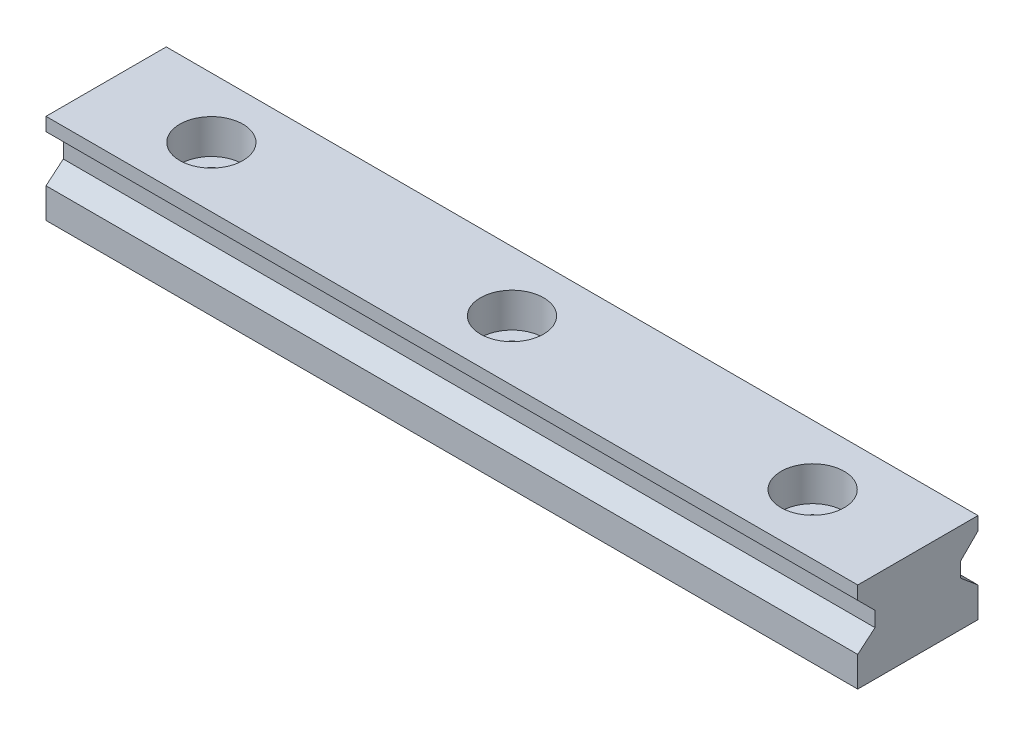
ISO-10303-21;
HEADER;
FILE_DESCRIPTION(('STEP AP214'),'2;1');
FILE_NAME('part.step','',(''),(''),'','','');
FILE_SCHEMA(('AUTOMOTIVE_DESIGN { 1 0 10303 214 1 1 1 1 }'));
ENDSEC;
DATA;
#1=APPLICATION_CONTEXT('core data for automotive mechanical design processes');
#2=APPLICATION_PROTOCOL_DEFINITION('international standard','automotive_design',2000,#1);
#3=PRODUCT_CONTEXT('',#1,'mechanical');
#4=PRODUCT('Part','Part','',(#3));
#5=PRODUCT_RELATED_PRODUCT_CATEGORY('part','',(#4));
#6=PRODUCT_DEFINITION_FORMATION('','',#4);
#7=PRODUCT_DEFINITION_CONTEXT('part definition',#1,'design');
#8=PRODUCT_DEFINITION('design','',#6,#7);
#9=PRODUCT_DEFINITION_SHAPE('','',#8);
#10=(LENGTH_UNIT() NAMED_UNIT(*) SI_UNIT(.MILLI.,.METRE.));
#11=(NAMED_UNIT(*) PLANE_ANGLE_UNIT() SI_UNIT($,.RADIAN.));
#12=(NAMED_UNIT(*) SI_UNIT($,.STERADIAN.) SOLID_ANGLE_UNIT());
#13=UNCERTAINTY_MEASURE_WITH_UNIT(LENGTH_MEASURE(1.E-05),#10,'distance_accuracy_value','');
#14=(GEOMETRIC_REPRESENTATION_CONTEXT(3) GLOBAL_UNCERTAINTY_ASSIGNED_CONTEXT((#13)) GLOBAL_UNIT_ASSIGNED_CONTEXT((#10,
#11,#12)) REPRESENTATION_CONTEXT('',''));
#15=CARTESIAN_POINT('',(0.,0.,0.));
#16=DIRECTION('',(0.,0.,1.));
#17=DIRECTION('',(1.,0.,0.));
#18=AXIS2_PLACEMENT_3D('',#15,#16,#17);
#19=CARTESIAN_POINT('',(-27.,5.114964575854,4.));
#20=DIRECTION('',(0.,-0.707106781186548,0.707106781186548));
#21=DIRECTION('',(0.,-0.707106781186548,-0.707106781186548));
#22=AXIS2_PLACEMENT_3D('',#19,#20,#21);
#23=PLANE('',#22);
#24=DIRECTION('',(1.,0.,0.));
#25=VECTOR('',#24,1.);
#26=CARTESIAN_POINT('',(-27.,5.114964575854,4.));
#27=LINE('',#26,#25);
#28=CARTESIAN_POINT('',(-27.,5.114964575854,4.));
#29=VERTEX_POINT('',#28);
#30=CARTESIAN_POINT('',(27.,5.114964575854,4.));
#31=VERTEX_POINT('',#30);
#32=EDGE_CURVE('E209',#29,#31,#27,.T.);
#33=ORIENTED_EDGE('',*,*,#32,.F.);
#34=DIRECTION('',(0.,-0.707106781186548,-0.707106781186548));
#35=VECTOR('',#34,1.);
#36=CARTESIAN_POINT('',(-27.,5.114964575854,4.));
#37=LINE('',#36,#35);
#38=CARTESIAN_POINT('',(-27.,3.964964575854,2.85));
#39=VERTEX_POINT('',#38);
#40=EDGE_CURVE('E117',#29,#39,#37,.T.);
#41=ORIENTED_EDGE('',*,*,#40,.T.);
#42=DIRECTION('',(1.,0.,0.));
#43=VECTOR('',#42,1.);
#44=CARTESIAN_POINT('',(-27.,3.964964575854,2.85));
#45=LINE('',#44,#43);
#46=CARTESIAN_POINT('',(27.,3.964964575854,2.85));
#47=VERTEX_POINT('',#46);
#48=EDGE_CURVE('E214',#47,#39,#45,.F.);
#49=ORIENTED_EDGE('',*,*,#48,.F.);
#50=DIRECTION('',(0.,-0.707106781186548,-0.707106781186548));
#51=VECTOR('',#50,1.);
#52=CARTESIAN_POINT('',(27.,5.114964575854,4.));
#53=LINE('',#52,#51);
#54=EDGE_CURVE('E136',#47,#31,#53,.F.);
#55=ORIENTED_EDGE('',*,*,#54,.T.);
#56=EDGE_LOOP('',(#33,#41,#49,#55));
#57=FACE_BOUND('',#56,.T.);
#58=ADVANCED_FACE('F16',(#57),#23,.T.);
#59=CARTESIAN_POINT('',(-27.,3.964964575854,-2.85));
#60=DIRECTION('',(0.,-0.707106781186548,-0.707106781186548));
#61=DIRECTION('',(0.,0.707106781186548,-0.707106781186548));
#62=AXIS2_PLACEMENT_3D('',#59,#60,#61);
#63=PLANE('',#62);
#64=DIRECTION('',(-1.,0.,0.));
#65=VECTOR('',#64,1.);
#66=CARTESIAN_POINT('',(-27.,3.964964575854,-2.85));
#67=LINE('',#66,#65);
#68=CARTESIAN_POINT('',(-27.,3.964964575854,-2.85));
#69=VERTEX_POINT('',#68);
#70=CARTESIAN_POINT('',(27.,3.964964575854,-2.85));
#71=VERTEX_POINT('',#70);
#72=EDGE_CURVE('E111',#69,#71,#67,.F.);
#73=ORIENTED_EDGE('',*,*,#72,.F.);
#74=DIRECTION('',(0.,0.707106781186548,-0.707106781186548));
#75=VECTOR('',#74,1.);
#76=CARTESIAN_POINT('',(-27.,3.964964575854,-2.85));
#77=LINE('',#76,#75);
#78=CARTESIAN_POINT('',(-27.,5.114964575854,-4.));
#79=VERTEX_POINT('',#78);
#80=EDGE_CURVE('E102',#69,#79,#77,.T.);
#81=ORIENTED_EDGE('',*,*,#80,.T.);
#82=DIRECTION('',(-1.,0.,0.));
#83=VECTOR('',#82,1.);
#84=CARTESIAN_POINT('',(-27.,5.114964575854,-4.));
#85=LINE('',#84,#83);
#86=CARTESIAN_POINT('',(27.,5.114964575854,-4.));
#87=VERTEX_POINT('',#86);
#88=EDGE_CURVE('E114',#87,#79,#85,.T.);
#89=ORIENTED_EDGE('',*,*,#88,.F.);
#90=DIRECTION('',(0.,0.707106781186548,-0.707106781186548));
#91=VECTOR('',#90,1.);
#92=CARTESIAN_POINT('',(27.,3.964964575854,-2.85));
#93=LINE('',#92,#91);
#94=EDGE_CURVE('E107',#87,#71,#93,.F.);
#95=ORIENTED_EDGE('',*,*,#94,.T.);
#96=EDGE_LOOP('',(#73,#81,#89,#95));
#97=FACE_BOUND('',#96,.T.);
#98=ADVANCED_FACE('F109',(#97),#63,.T.);
#99=CARTESIAN_POINT('',(-27.,2.964964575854,-2.85));
#100=DIRECTION('',(0.,0.,-1.));
#101=DIRECTION('',(-1.,0.,0.));
#102=AXIS2_PLACEMENT_3D('',#99,#100,#101);
#103=PLANE('',#102);
#104=DIRECTION('',(1.,0.,0.));
#105=VECTOR('',#104,1.);
#106=CARTESIAN_POINT('',(-27.,2.96496457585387,-2.84999999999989));
#107=LINE('',#106,#105);
#108=CARTESIAN_POINT('',(-27.,2.96496457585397,-2.84999999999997));
#109=VERTEX_POINT('',#108);
#110=CARTESIAN_POINT('',(27.,2.96496457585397,-2.84999999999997));
#111=VERTEX_POINT('',#110);
#112=EDGE_CURVE('E197',#109,#111,#107,.T.);
#113=ORIENTED_EDGE('',*,*,#112,.F.);
#114=DIRECTION('',(0.,1.,0.));
#115=VECTOR('',#114,1.);
#116=CARTESIAN_POINT('',(-27.,2.964964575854,-2.85));
#117=LINE('',#116,#115);
#118=EDGE_CURVE('E128',#109,#69,#117,.T.);
#119=ORIENTED_EDGE('',*,*,#118,.T.);
#120=ORIENTED_EDGE('',*,*,#72,.T.);
#121=DIRECTION('',(0.,1.,0.));
#122=VECTOR('',#121,1.);
#123=CARTESIAN_POINT('',(27.,2.964964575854,-2.85));
#124=LINE('',#123,#122);
#125=EDGE_CURVE('E120',#71,#111,#124,.F.);
#126=ORIENTED_EDGE('',*,*,#125,.T.);
#127=EDGE_LOOP('',(#113,#119,#120,#126));
#128=FACE_BOUND('',#127,.T.);
#129=ADVANCED_FACE('F130',(#128),#103,.T.);
#130=CARTESIAN_POINT('',(-27.,3.964964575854,2.85));
#131=DIRECTION('',(0.,0.,1.));
#132=DIRECTION('',(1.,0.,0.));
#133=AXIS2_PLACEMENT_3D('',#130,#131,#132);
#134=PLANE('',#133);
#135=ORIENTED_EDGE('',*,*,#48,.T.);
#136=DIRECTION('',(0.,1.,0.));
#137=VECTOR('',#136,1.);
#138=CARTESIAN_POINT('',(-27.,3.964964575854,2.85));
#139=LINE('',#138,#137);
#140=CARTESIAN_POINT('',(-27.,2.964964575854,2.85));
#141=VERTEX_POINT('',#140);
#142=EDGE_CURVE('E212',#39,#141,#139,.F.);
#143=ORIENTED_EDGE('',*,*,#142,.T.);
#144=DIRECTION('',(1.,0.,0.));
#145=VECTOR('',#144,1.);
#146=CARTESIAN_POINT('',(-27.,2.964964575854,2.85));
#147=LINE('',#146,#145);
#148=CARTESIAN_POINT('',(27.,2.964964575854,2.85));
#149=VERTEX_POINT('',#148);
#150=EDGE_CURVE('E190',#149,#141,#147,.F.);
#151=ORIENTED_EDGE('',*,*,#150,.F.);
#152=DIRECTION('',(0.,1.,0.));
#153=VECTOR('',#152,1.);
#154=CARTESIAN_POINT('',(27.,3.964964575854,2.85));
#155=LINE('',#154,#153);
#156=EDGE_CURVE('E217',#149,#47,#155,.T.);
#157=ORIENTED_EDGE('',*,*,#156,.T.);
#158=EDGE_LOOP('',(#135,#143,#151,#157));
#159=FACE_BOUND('',#158,.T.);
#160=ADVANCED_FACE('F221',(#159),#134,.T.);
#161=CARTESIAN_POINT('',(-27.,6.,4.));
#162=DIRECTION('',(0.,0.,1.));
#163=DIRECTION('',(1.,0.,0.));
#164=AXIS2_PLACEMENT_3D('',#161,#162,#163);
#165=PLANE('',#164);
#166=DIRECTION('',(1.,0.,0.));
#167=VECTOR('',#166,1.);
#168=CARTESIAN_POINT('',(-27.,6.,4.));
#169=LINE('',#168,#167);
#170=CARTESIAN_POINT('',(-27.,6.,4.));
#171=VERTEX_POINT('',#170);
#172=CARTESIAN_POINT('',(27.,6.,4.));
#173=VERTEX_POINT('',#172);
#174=EDGE_CURVE('E176',#171,#173,#169,.T.);
#175=ORIENTED_EDGE('',*,*,#174,.F.);
#176=DIRECTION('',(0.,1.,0.));
#177=VECTOR('',#176,1.);
#178=CARTESIAN_POINT('',(-27.,6.,4.));
#179=LINE('',#178,#177);
#180=EDGE_CURVE('E204',#171,#29,#179,.F.);
#181=ORIENTED_EDGE('',*,*,#180,.T.);
#182=ORIENTED_EDGE('',*,*,#32,.T.);
#183=DIRECTION('',(0.,1.,0.));
#184=VECTOR('',#183,1.);
#185=CARTESIAN_POINT('',(27.,6.,4.));
#186=LINE('',#185,#184);
#187=EDGE_CURVE('E207',#31,#173,#186,.T.);
#188=ORIENTED_EDGE('',*,*,#187,.T.);
#189=EDGE_LOOP('',(#175,#181,#182,#188));
#190=FACE_BOUND('',#189,.T.);
#191=ADVANCED_FACE('F322',(#190),#165,.T.);
#192=CARTESIAN_POINT('',(-27.,5.114964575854,-4.));
#193=DIRECTION('',(0.,0.,-1.));
#194=DIRECTION('',(-1.,0.,0.));
#195=AXIS2_PLACEMENT_3D('',#192,#193,#194);
#196=PLANE('',#195);
#197=ORIENTED_EDGE('',*,*,#88,.T.);
#198=DIRECTION('',(0.,1.,0.));
#199=VECTOR('',#198,1.);
#200=CARTESIAN_POINT('',(-27.,5.114964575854,-4.));
#201=LINE('',#200,#199);
#202=CARTESIAN_POINT('',(-27.,6.,-4.));
#203=VERTEX_POINT('',#202);
#204=EDGE_CURVE('E199',#79,#203,#201,.T.);
#205=ORIENTED_EDGE('',*,*,#204,.T.);
#206=DIRECTION('',(1.,0.,0.));
#207=VECTOR('',#206,1.);
#208=CARTESIAN_POINT('',(-27.,6.,-4.));
#209=LINE('',#208,#207);
#210=CARTESIAN_POINT('',(27.,6.,-4.));
#211=VERTEX_POINT('',#210);
#212=EDGE_CURVE('E172',#211,#203,#209,.F.);
#213=ORIENTED_EDGE('',*,*,#212,.F.);
#214=DIRECTION('',(0.,1.,0.));
#215=VECTOR('',#214,1.);
#216=CARTESIAN_POINT('',(27.,5.114964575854,-4.));
#217=LINE('',#216,#215);
#218=EDGE_CURVE('E202',#211,#87,#217,.F.);
#219=ORIENTED_EDGE('',*,*,#218,.T.);
#220=EDGE_LOOP('',(#197,#205,#213,#219));
#221=FACE_BOUND('',#220,.T.);
#222=ADVANCED_FACE('F313',(#221),#196,.T.);
#223=CARTESIAN_POINT('',(20.,-0.3,0.));
#224=DIRECTION('',(0.,1.,0.));
#225=DIRECTION('',(0.,0.,1.));
#226=AXIS2_PLACEMENT_3D('',#223,#224,#225);
#227=CYLINDRICAL_SURFACE('',#226,2.1);
#228=CARTESIAN_POINT('',(20.,3.7,0.));
#229=DIRECTION('',(0.,1.,0.));
#230=DIRECTION('',(0.,0.,1.));
#231=AXIS2_PLACEMENT_3D('',#228,#229,#230);
#232=CIRCLE('',#231,2.1);
#233=CARTESIAN_POINT('',(20.,3.7,2.1));
#234=VERTEX_POINT('',#233);
#235=EDGE_CURVE('E162',#234,#234,#232,.T.);
#236=ORIENTED_EDGE('',*,*,#235,.F.);
#237=EDGE_LOOP('',(#236));
#238=FACE_BOUND('',#237,.T.);
#239=CARTESIAN_POINT('',(20.,6.,0.));
#240=DIRECTION('',(0.,1.,0.));
#241=DIRECTION('',(0.,0.,1.));
#242=AXIS2_PLACEMENT_3D('',#239,#240,#241);
#243=CIRCLE('',#242,2.1);
#244=CARTESIAN_POINT('',(20.,6.,2.1));
#245=VERTEX_POINT('',#244);
#246=EDGE_CURVE('E19',#245,#245,#243,.F.);
#247=ORIENTED_EDGE('',*,*,#246,.F.);
#248=EDGE_LOOP('',(#247));
#249=FACE_BOUND('',#248,.T.);
#250=ADVANCED_FACE('F309',(#238,#249),#227,.F.);
#251=CARTESIAN_POINT('',(0.,-0.3,0.));
#252=DIRECTION('',(0.,1.,0.));
#253=DIRECTION('',(0.,0.,1.));
#254=AXIS2_PLACEMENT_3D('',#251,#252,#253);
#255=CYLINDRICAL_SURFACE('',#254,2.1);
#256=CARTESIAN_POINT('',(0.,3.7,0.));
#257=DIRECTION('',(0.,1.,0.));
#258=DIRECTION('',(0.,0.,1.));
#259=AXIS2_PLACEMENT_3D('',#256,#257,#258);
#260=CIRCLE('',#259,2.1);
#261=CARTESIAN_POINT('',(0.,3.7,2.1));
#262=VERTEX_POINT('',#261);
#263=EDGE_CURVE('E159',#262,#262,#260,.T.);
#264=ORIENTED_EDGE('',*,*,#263,.F.);
#265=EDGE_LOOP('',(#264));
#266=FACE_BOUND('',#265,.T.);
#267=CARTESIAN_POINT('',(0.,6.,0.));
#268=DIRECTION('',(0.,1.,0.));
#269=DIRECTION('',(0.,0.,1.));
#270=AXIS2_PLACEMENT_3D('',#267,#268,#269);
#271=CIRCLE('',#270,2.1);
#272=CARTESIAN_POINT('',(0.,6.,2.1));
#273=VERTEX_POINT('',#272);
#274=EDGE_CURVE('E167',#273,#273,#271,.F.);
#275=ORIENTED_EDGE('',*,*,#274,.F.);
#276=EDGE_LOOP('',(#275));
#277=FACE_BOUND('',#276,.T.);
#278=ADVANCED_FACE('F312',(#266,#277),#255,.F.);
#279=CARTESIAN_POINT('',(-20.,-0.3,0.));
#280=DIRECTION('',(0.,1.,0.));
#281=DIRECTION('',(0.,0.,1.));
#282=AXIS2_PLACEMENT_3D('',#279,#280,#281);
#283=CYLINDRICAL_SURFACE('',#282,2.1);
#284=CARTESIAN_POINT('',(-20.,3.7,0.));
#285=DIRECTION('',(0.,1.,0.));
#286=DIRECTION('',(0.,0.,1.));
#287=AXIS2_PLACEMENT_3D('',#284,#285,#286);
#288=CIRCLE('',#287,2.1);
#289=CARTESIAN_POINT('',(-20.,3.7,2.1));
#290=VERTEX_POINT('',#289);
#291=EDGE_CURVE('E155',#290,#290,#288,.T.);
#292=ORIENTED_EDGE('',*,*,#291,.F.);
#293=EDGE_LOOP('',(#292));
#294=FACE_BOUND('',#293,.T.);
#295=CARTESIAN_POINT('',(-20.,6.,0.));
#296=DIRECTION('',(0.,1.,0.));
#297=DIRECTION('',(0.,0.,1.));
#298=AXIS2_PLACEMENT_3D('',#295,#296,#297);
#299=CIRCLE('',#298,2.1);
#300=CARTESIAN_POINT('',(-20.,6.,2.1));
#301=VERTEX_POINT('',#300);
#302=EDGE_CURVE('E165',#301,#301,#299,.F.);
#303=ORIENTED_EDGE('',*,*,#302,.F.);
#304=EDGE_LOOP('',(#303));
#305=FACE_BOUND('',#304,.T.);
#306=ADVANCED_FACE('F319',(#294,#305),#283,.F.);
#307=CARTESIAN_POINT('',(-27.,2.,-4.));
#308=DIRECTION('',(0.,0.766044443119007,-0.642787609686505));
#309=DIRECTION('',(0.,0.642787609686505,0.766044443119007));
#310=AXIS2_PLACEMENT_3D('',#307,#308,#309);
#311=PLANE('',#310);
#312=DIRECTION('',(-1.,0.,0.));
#313=VECTOR('',#312,1.);
#314=CARTESIAN_POINT('',(-27.,2.,-4.));
#315=LINE('',#314,#313);
#316=CARTESIAN_POINT('',(-27.,2.,-4.));
#317=VERTEX_POINT('',#316);
#318=CARTESIAN_POINT('',(27.,2.,-4.));
#319=VERTEX_POINT('',#318);
#320=EDGE_CURVE('E158',#317,#319,#315,.F.);
#321=ORIENTED_EDGE('',*,*,#320,.F.);
#322=DIRECTION('',(0.,0.642787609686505,0.766044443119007));
#323=VECTOR('',#322,1.);
#324=CARTESIAN_POINT('',(-27.,2.,-4.));
#325=LINE('',#324,#323);
#326=EDGE_CURVE('E193',#317,#109,#325,.T.);
#327=ORIENTED_EDGE('',*,*,#326,.T.);
#328=ORIENTED_EDGE('',*,*,#112,.T.);
#329=DIRECTION('',(0.,0.642787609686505,0.766044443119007));
#330=VECTOR('',#329,1.);
#331=CARTESIAN_POINT('',(27.,2.,-4.));
#332=LINE('',#331,#330);
#333=EDGE_CURVE('E124',#111,#319,#332,.F.);
#334=ORIENTED_EDGE('',*,*,#333,.T.);
#335=EDGE_LOOP('',(#321,#327,#328,#334));
#336=FACE_BOUND('',#335,.T.);
#337=ADVANCED_FACE('F391',(#336),#311,.T.);
#338=CARTESIAN_POINT('',(-27.,2.964964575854,2.85));
#339=DIRECTION('',(0.,0.766044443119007,0.642787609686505));
#340=DIRECTION('',(0.,-0.642787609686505,0.766044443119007));
#341=AXIS2_PLACEMENT_3D('',#338,#339,#340);
#342=PLANE('',#341);
#343=ORIENTED_EDGE('',*,*,#150,.T.);
#344=DIRECTION('',(0.,-0.642787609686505,0.766044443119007));
#345=VECTOR('',#344,1.);
#346=CARTESIAN_POINT('',(-27.,2.964964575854,2.85));
#347=LINE('',#346,#345);
#348=CARTESIAN_POINT('',(-27.,2.00000000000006,4.00000000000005));
#349=VERTEX_POINT('',#348);
#350=EDGE_CURVE('E184',#141,#349,#347,.T.);
#351=ORIENTED_EDGE('',*,*,#350,.T.);
#352=DIRECTION('',(1.,0.,0.));
#353=VECTOR('',#352,1.);
#354=CARTESIAN_POINT('',(-27.,2.,4.));
#355=LINE('',#354,#353);
#356=CARTESIAN_POINT('',(27.,2.00000000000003,4.00000000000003));
#357=VERTEX_POINT('',#356);
#358=EDGE_CURVE('E234',#357,#349,#355,.F.);
#359=ORIENTED_EDGE('',*,*,#358,.F.);
#360=DIRECTION('',(0.,-0.64278760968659,0.766044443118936));
#361=VECTOR('',#360,1.);
#362=CARTESIAN_POINT('',(27.,2.964964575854,2.85));
#363=LINE('',#362,#361);
#364=EDGE_CURVE('E224',#149,#357,#363,.T.);
#365=ORIENTED_EDGE('',*,*,#364,.F.);
#366=EDGE_LOOP('',(#343,#351,#359,#365));
#367=FACE_BOUND('',#366,.T.);
#368=ADVANCED_FACE('F233',(#367),#342,.T.);
#369=CARTESIAN_POINT('',(-27.,6.,-4.));
#370=DIRECTION('',(0.,1.,0.));
#371=DIRECTION('',(0.,0.,1.));
#372=AXIS2_PLACEMENT_3D('',#369,#370,#371);
#373=PLANE('',#372);
#374=ORIENTED_EDGE('',*,*,#302,.T.);
#375=EDGE_LOOP('',(#374));
#376=FACE_BOUND('',#375,.T.);
#377=ORIENTED_EDGE('',*,*,#274,.T.);
#378=EDGE_LOOP('',(#377));
#379=FACE_BOUND('',#378,.T.);
#380=ORIENTED_EDGE('',*,*,#246,.T.);
#381=EDGE_LOOP('',(#380));
#382=FACE_BOUND('',#381,.T.);
#383=ORIENTED_EDGE('',*,*,#212,.T.);
#384=DIRECTION('',(0.,0.,-1.));
#385=VECTOR('',#384,1.);
#386=CARTESIAN_POINT('',(-27.,6.,0.));
#387=LINE('',#386,#385);
#388=EDGE_CURVE('E154',#203,#171,#387,.F.);
#389=ORIENTED_EDGE('',*,*,#388,.T.);
#390=ORIENTED_EDGE('',*,*,#174,.T.);
#391=DIRECTION('',(0.,0.,-1.));
#392=VECTOR('',#391,1.);
#393=CARTESIAN_POINT('',(27.,6.,0.));
#394=LINE('',#393,#392);
#395=EDGE_CURVE('E237',#211,#173,#394,.F.);
#396=ORIENTED_EDGE('',*,*,#395,.F.);
#397=EDGE_LOOP('',(#383,#389,#390,#396));
#398=FACE_BOUND('',#397,.T.);
#399=ADVANCED_FACE('F305',(#376,#379,#382,#398),#373,.T.);
#400=CARTESIAN_POINT('',(20.,3.7,0.));
#401=DIRECTION('',(0.,1.,0.));
#402=DIRECTION('',(0.,0.,1.));
#403=AXIS2_PLACEMENT_3D('',#400,#401,#402);
#404=PLANE('',#403);
#405=CARTESIAN_POINT('',(20.,3.7,0.));
#406=DIRECTION('',(0.,1.,0.));
#407=DIRECTION('',(0.,0.,1.));
#408=AXIS2_PLACEMENT_3D('',#405,#406,#407);
#409=CIRCLE('',#408,1.2);
#410=CARTESIAN_POINT('',(20.,3.7,1.2));
#411=VERTEX_POINT('',#410);
#412=EDGE_CURVE('E151',#411,#411,#409,.F.);
#413=ORIENTED_EDGE('',*,*,#412,.T.);
#414=EDGE_LOOP('',(#413));
#415=FACE_BOUND('',#414,.T.);
#416=ORIENTED_EDGE('',*,*,#235,.T.);
#417=EDGE_LOOP('',(#416));
#418=FACE_BOUND('',#417,.T.);
#419=ADVANCED_FACE('F301',(#415,#418),#404,.T.);
#420=CARTESIAN_POINT('',(0.,3.7,0.));
#421=DIRECTION('',(0.,1.,0.));
#422=DIRECTION('',(0.,0.,1.));
#423=AXIS2_PLACEMENT_3D('',#420,#421,#422);
#424=PLANE('',#423);
#425=CARTESIAN_POINT('',(0.,3.7,0.));
#426=DIRECTION('',(0.,1.,0.));
#427=DIRECTION('',(0.,0.,1.));
#428=AXIS2_PLACEMENT_3D('',#425,#426,#427);
#429=CIRCLE('',#428,1.2);
#430=CARTESIAN_POINT('',(0.,3.7,1.2));
#431=VERTEX_POINT('',#430);
#432=EDGE_CURVE('E148',#431,#431,#429,.F.);
#433=ORIENTED_EDGE('',*,*,#432,.T.);
#434=EDGE_LOOP('',(#433));
#435=FACE_BOUND('',#434,.T.);
#436=ORIENTED_EDGE('',*,*,#263,.T.);
#437=EDGE_LOOP('',(#436));
#438=FACE_BOUND('',#437,.T.);
#439=ADVANCED_FACE('F304',(#435,#438),#424,.T.);
#440=CARTESIAN_POINT('',(-20.,3.7,0.));
#441=DIRECTION('',(0.,1.,0.));
#442=DIRECTION('',(0.,0.,1.));
#443=AXIS2_PLACEMENT_3D('',#440,#441,#442);
#444=PLANE('',#443);
#445=CARTESIAN_POINT('',(-20.,3.7,0.));
#446=DIRECTION('',(0.,1.,0.));
#447=DIRECTION('',(0.,0.,1.));
#448=AXIS2_PLACEMENT_3D('',#445,#446,#447);
#449=CIRCLE('',#448,1.2);
#450=CARTESIAN_POINT('',(-20.,3.7,1.2));
#451=VERTEX_POINT('',#450);
#452=EDGE_CURVE('E144',#451,#451,#449,.F.);
#453=ORIENTED_EDGE('',*,*,#452,.T.);
#454=EDGE_LOOP('',(#453));
#455=FACE_BOUND('',#454,.T.);
#456=ORIENTED_EDGE('',*,*,#291,.T.);
#457=EDGE_LOOP('',(#456));
#458=FACE_BOUND('',#457,.T.);
#459=ADVANCED_FACE('F432',(#455,#458),#444,.T.);
#460=CARTESIAN_POINT('',(-27.,0.,-4.));
#461=DIRECTION('',(0.,0.,-1.));
#462=DIRECTION('',(-1.,0.,0.));
#463=AXIS2_PLACEMENT_3D('',#460,#461,#462);
#464=PLANE('',#463);
#465=DIRECTION('',(1.,0.,0.));
#466=VECTOR('',#465,1.);
#467=CARTESIAN_POINT('',(-27.,0.,-4.));
#468=LINE('',#467,#466);
#469=CARTESIAN_POINT('',(-27.,0.,-4.));
#470=VERTEX_POINT('',#469);
#471=CARTESIAN_POINT('',(27.,0.,-4.));
#472=VERTEX_POINT('',#471);
#473=EDGE_CURVE('E147',#470,#472,#468,.T.);
#474=ORIENTED_EDGE('',*,*,#473,.F.);
#475=DIRECTION('',(0.,1.,0.));
#476=VECTOR('',#475,1.);
#477=CARTESIAN_POINT('',(-27.,0.,-4.));
#478=LINE('',#477,#476);
#479=EDGE_CURVE('E246',#470,#317,#478,.T.);
#480=ORIENTED_EDGE('',*,*,#479,.T.);
#481=ORIENTED_EDGE('',*,*,#320,.T.);
#482=DIRECTION('',(0.,1.,0.));
#483=VECTOR('',#482,1.);
#484=CARTESIAN_POINT('',(27.,0.,-4.));
#485=LINE('',#484,#483);
#486=EDGE_CURVE('E236',#472,#319,#485,.T.);
#487=ORIENTED_EDGE('',*,*,#486,.F.);
#488=EDGE_LOOP('',(#474,#480,#481,#487));
#489=FACE_BOUND('',#488,.T.);
#490=ADVANCED_FACE('F264',(#489),#464,.T.);
#491=CARTESIAN_POINT('',(27.,0.,0.));
#492=DIRECTION('',(1.,0.,0.));
#493=DIRECTION('',(0.,0.,-1.));
#494=AXIS2_PLACEMENT_3D('',#491,#492,#493);
#495=PLANE('',#494);
#496=ORIENTED_EDGE('',*,*,#395,.T.);
#497=ORIENTED_EDGE('',*,*,#187,.F.);
#498=ORIENTED_EDGE('',*,*,#54,.F.);
#499=ORIENTED_EDGE('',*,*,#156,.F.);
#500=ORIENTED_EDGE('',*,*,#364,.T.);
#501=DIRECTION('',(0.,1.,0.));
#502=VECTOR('',#501,1.);
#503=CARTESIAN_POINT('',(27.,2.,4.));
#504=LINE('',#503,#502);
#505=CARTESIAN_POINT('',(27.,0.,4.));
#506=VERTEX_POINT('',#505);
#507=EDGE_CURVE('E242',#506,#357,#504,.T.);
#508=ORIENTED_EDGE('',*,*,#507,.F.);
#509=DIRECTION('',(0.,0.,-1.));
#510=VECTOR('',#509,1.);
#511=CARTESIAN_POINT('',(27.,0.,4.));
#512=LINE('',#511,#510);
#513=EDGE_CURVE('E252',#472,#506,#512,.F.);
#514=ORIENTED_EDGE('',*,*,#513,.F.);
#515=ORIENTED_EDGE('',*,*,#486,.T.);
#516=ORIENTED_EDGE('',*,*,#333,.F.);
#517=ORIENTED_EDGE('',*,*,#125,.F.);
#518=ORIENTED_EDGE('',*,*,#94,.F.);
#519=ORIENTED_EDGE('',*,*,#218,.F.);
#520=EDGE_LOOP('',(#496,#497,#498,#499,#500,#508,#514,#515,#516,#517,#518,#519));
#521=FACE_BOUND('',#520,.T.);
#522=ADVANCED_FACE('F122',(#521),#495,.T.);
#523=CARTESIAN_POINT('',(-27.,2.,4.));
#524=DIRECTION('',(0.,0.,1.));
#525=DIRECTION('',(1.,0.,0.));
#526=AXIS2_PLACEMENT_3D('',#523,#524,#525);
#527=PLANE('',#526);
#528=ORIENTED_EDGE('',*,*,#358,.T.);
#529=DIRECTION('',(0.,1.,0.));
#530=VECTOR('',#529,1.);
#531=CARTESIAN_POINT('',(-27.,0.,4.));
#532=LINE('',#531,#530);
#533=CARTESIAN_POINT('',(-27.,0.,4.));
#534=VERTEX_POINT('',#533);
#535=EDGE_CURVE('E34',#349,#534,#532,.F.);
#536=ORIENTED_EDGE('',*,*,#535,.T.);
#537=DIRECTION('',(1.,0.,0.));
#538=VECTOR('',#537,1.);
#539=CARTESIAN_POINT('',(-27.,0.,4.));
#540=LINE('',#539,#538);
#541=EDGE_CURVE('E255',#506,#534,#540,.F.);
#542=ORIENTED_EDGE('',*,*,#541,.F.);
#543=ORIENTED_EDGE('',*,*,#507,.T.);
#544=EDGE_LOOP('',(#528,#536,#542,#543));
#545=FACE_BOUND('',#544,.T.);
#546=ADVANCED_FACE('F266',(#545),#527,.T.);
#547=CARTESIAN_POINT('',(-27.,0.,0.));
#548=DIRECTION('',(1.,0.,0.));
#549=DIRECTION('',(0.,0.,-1.));
#550=AXIS2_PLACEMENT_3D('',#547,#548,#549);
#551=PLANE('',#550);
#552=ORIENTED_EDGE('',*,*,#204,.F.);
#553=ORIENTED_EDGE('',*,*,#80,.F.);
#554=ORIENTED_EDGE('',*,*,#118,.F.);
#555=ORIENTED_EDGE('',*,*,#326,.F.);
#556=ORIENTED_EDGE('',*,*,#479,.F.);
#557=DIRECTION('',(0.,0.,-1.));
#558=VECTOR('',#557,1.);
#559=CARTESIAN_POINT('',(-27.,0.,4.));
#560=LINE('',#559,#558);
#561=EDGE_CURVE('E143',#534,#470,#560,.T.);
#562=ORIENTED_EDGE('',*,*,#561,.F.);
#563=ORIENTED_EDGE('',*,*,#535,.F.);
#564=ORIENTED_EDGE('',*,*,#350,.F.);
#565=ORIENTED_EDGE('',*,*,#142,.F.);
#566=ORIENTED_EDGE('',*,*,#40,.F.);
#567=ORIENTED_EDGE('',*,*,#180,.F.);
#568=ORIENTED_EDGE('',*,*,#388,.F.);
#569=EDGE_LOOP('',(#552,#553,#554,#555,#556,#562,#563,#564,#565,#566,#567,#568));
#570=FACE_BOUND('',#569,.T.);
#571=ADVANCED_FACE('F231',(#570),#551,.F.);
#572=CARTESIAN_POINT('',(20.,-0.3,0.));
#573=DIRECTION('',(0.,1.,0.));
#574=DIRECTION('',(0.,0.,1.));
#575=AXIS2_PLACEMENT_3D('',#572,#573,#574);
#576=CYLINDRICAL_SURFACE('',#575,1.2);
#577=ORIENTED_EDGE('',*,*,#412,.F.);
#578=EDGE_LOOP('',(#577));
#579=FACE_BOUND('',#578,.T.);
#580=CARTESIAN_POINT('',(20.,0.,0.));
#581=DIRECTION('',(0.,1.,0.));
#582=DIRECTION('',(0.,0.,1.));
#583=AXIS2_PLACEMENT_3D('',#580,#581,#582);
#584=CIRCLE('',#583,1.2);
#585=CARTESIAN_POINT('',(20.,0.,1.2));
#586=VERTEX_POINT('',#585);
#587=EDGE_CURVE('E140',#586,#586,#584,.T.);
#588=ORIENTED_EDGE('',*,*,#587,.F.);
#589=EDGE_LOOP('',(#588));
#590=FACE_BOUND('',#589,.T.);
#591=ADVANCED_FACE('F274',(#579,#590),#576,.F.);
#592=CARTESIAN_POINT('',(0.,-0.3,0.));
#593=DIRECTION('',(0.,1.,0.));
#594=DIRECTION('',(0.,0.,1.));
#595=AXIS2_PLACEMENT_3D('',#592,#593,#594);
#596=CYLINDRICAL_SURFACE('',#595,1.2);
#597=ORIENTED_EDGE('',*,*,#432,.F.);
#598=EDGE_LOOP('',(#597));
#599=FACE_BOUND('',#598,.T.);
#600=CARTESIAN_POINT('',(0.,0.,0.));
#601=DIRECTION('',(0.,1.,0.));
#602=DIRECTION('',(0.,0.,1.));
#603=AXIS2_PLACEMENT_3D('',#600,#601,#602);
#604=CIRCLE('',#603,1.2);
#605=CARTESIAN_POINT('',(0.,0.,1.2));
#606=VERTEX_POINT('',#605);
#607=EDGE_CURVE('E25',#606,#606,#604,.T.);
#608=ORIENTED_EDGE('',*,*,#607,.F.);
#609=EDGE_LOOP('',(#608));
#610=FACE_BOUND('',#609,.T.);
#611=ADVANCED_FACE('F284',(#599,#610),#596,.F.);
#612=CARTESIAN_POINT('',(-20.,-0.3,0.));
#613=DIRECTION('',(0.,1.,0.));
#614=DIRECTION('',(0.,0.,1.));
#615=AXIS2_PLACEMENT_3D('',#612,#613,#614);
#616=CYLINDRICAL_SURFACE('',#615,1.2);
#617=ORIENTED_EDGE('',*,*,#452,.F.);
#618=EDGE_LOOP('',(#617));
#619=FACE_BOUND('',#618,.T.);
#620=CARTESIAN_POINT('',(-20.,0.,0.));
#621=DIRECTION('',(0.,1.,0.));
#622=DIRECTION('',(0.,0.,1.));
#623=AXIS2_PLACEMENT_3D('',#620,#621,#622);
#624=CIRCLE('',#623,1.2);
#625=CARTESIAN_POINT('',(-20.,0.,1.2));
#626=VERTEX_POINT('',#625);
#627=EDGE_CURVE('E11',#626,#626,#624,.T.);
#628=ORIENTED_EDGE('',*,*,#627,.F.);
#629=EDGE_LOOP('',(#628));
#630=FACE_BOUND('',#629,.T.);
#631=ADVANCED_FACE('F278',(#619,#630),#616,.F.);
#632=CARTESIAN_POINT('',(-27.,0.,4.));
#633=DIRECTION('',(0.,-1.,0.));
#634=DIRECTION('',(0.,0.,-1.));
#635=AXIS2_PLACEMENT_3D('',#632,#633,#634);
#636=PLANE('',#635);
#637=ORIENTED_EDGE('',*,*,#627,.T.);
#638=EDGE_LOOP('',(#637));
#639=FACE_BOUND('',#638,.T.);
#640=ORIENTED_EDGE('',*,*,#607,.T.);
#641=EDGE_LOOP('',(#640));
#642=FACE_BOUND('',#641,.T.);
#643=ORIENTED_EDGE('',*,*,#587,.T.);
#644=EDGE_LOOP('',(#643));
#645=FACE_BOUND('',#644,.T.);
#646=ORIENTED_EDGE('',*,*,#541,.T.);
#647=ORIENTED_EDGE('',*,*,#561,.T.);
#648=ORIENTED_EDGE('',*,*,#473,.T.);
#649=ORIENTED_EDGE('',*,*,#513,.T.);
#650=EDGE_LOOP('',(#646,#647,#648,#649));
#651=FACE_BOUND('',#650,.T.);
#652=ADVANCED_FACE('F260',(#639,#642,#645,#651),#636,.T.);
#653=CLOSED_SHELL('',(#58,#98,#129,#160,#191,#222,#250,#278,#306,#337,#368,#399,#419,#439,#459,
#490,#522,#546,#571,#591,#611,#631,#652));
#654=MANIFOLD_SOLID_BREP('B1',#653);
#655=ADVANCED_BREP_SHAPE_REPRESENTATION('',(#18,#654),#14);
#656=SHAPE_DEFINITION_REPRESENTATION(#9,#655);
ENDSEC;
END-ISO-10303-21;
